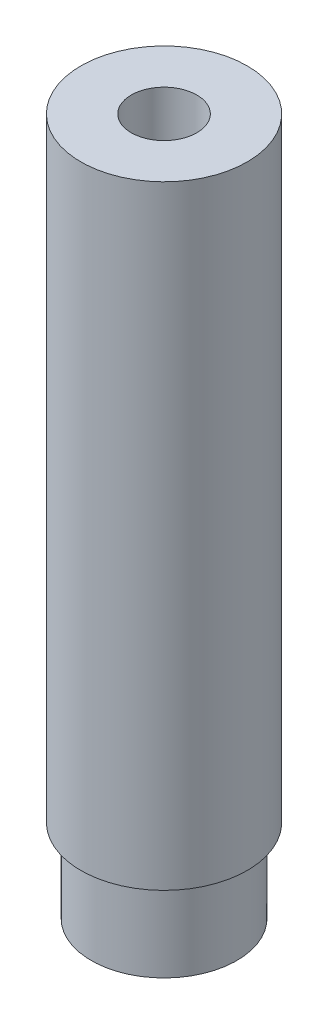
ISO-10303-21;
HEADER;
FILE_DESCRIPTION(('STEP AP214'),'2;1');
FILE_NAME('part.step','',(''),(''),'','','');
FILE_SCHEMA(('AUTOMOTIVE_DESIGN { 1 0 10303 214 1 1 1 1 }'));
ENDSEC;
DATA;
#1=APPLICATION_CONTEXT('core data for automotive mechanical design processes');
#2=APPLICATION_PROTOCOL_DEFINITION('international standard','automotive_design',2000,#1);
#3=PRODUCT_CONTEXT('',#1,'mechanical');
#4=PRODUCT('Part','Part','',(#3));
#5=PRODUCT_RELATED_PRODUCT_CATEGORY('part','',(#4));
#6=PRODUCT_DEFINITION_FORMATION('','',#4);
#7=PRODUCT_DEFINITION_CONTEXT('part definition',#1,'design');
#8=PRODUCT_DEFINITION('design','',#6,#7);
#9=PRODUCT_DEFINITION_SHAPE('','',#8);
#10=(LENGTH_UNIT() NAMED_UNIT(*) SI_UNIT(.MILLI.,.METRE.));
#11=(NAMED_UNIT(*) PLANE_ANGLE_UNIT() SI_UNIT($,.RADIAN.));
#12=(NAMED_UNIT(*) SI_UNIT($,.STERADIAN.) SOLID_ANGLE_UNIT());
#13=UNCERTAINTY_MEASURE_WITH_UNIT(LENGTH_MEASURE(1.E-05),#10,'distance_accuracy_value','');
#14=(GEOMETRIC_REPRESENTATION_CONTEXT(3) GLOBAL_UNCERTAINTY_ASSIGNED_CONTEXT((#13)) GLOBAL_UNIT_ASSIGNED_CONTEXT((#10,
#11,#12)) REPRESENTATION_CONTEXT('',''));
#15=CARTESIAN_POINT('',(0.,0.,0.));
#16=DIRECTION('',(0.,0.,1.));
#17=DIRECTION('',(1.,0.,0.));
#18=AXIS2_PLACEMENT_3D('',#15,#16,#17);
#19=CARTESIAN_POINT('',(0.,0.,0.));
#20=DIRECTION('',(0.,1.,0.));
#21=DIRECTION('',(0.,0.,1.));
#22=AXIS2_PLACEMENT_3D('',#19,#20,#21);
#23=PLANE('',#22);
#24=CARTESIAN_POINT('',(0.,0.,0.));
#25=DIRECTION('',(0.,-1.,0.));
#26=DIRECTION('',(0.,0.,-1.));
#27=AXIS2_PLACEMENT_3D('',#24,#25,#26);
#28=CIRCLE('',#27,7.);
#29=CARTESIAN_POINT('',(0.,0.,-7.));
#30=VERTEX_POINT('',#29);
#31=EDGE_CURVE('E34',#30,#30,#28,.F.);
#32=ORIENTED_EDGE('',*,*,#31,.F.);
#33=EDGE_LOOP('',(#32));
#34=FACE_BOUND('',#33,.T.);
#35=CARTESIAN_POINT('',(0.,0.,0.));
#36=DIRECTION('',(0.,1.,0.));
#37=DIRECTION('',(0.,0.,1.));
#38=AXIS2_PLACEMENT_3D('',#35,#36,#37);
#39=CIRCLE('',#38,3.15);
#40=CARTESIAN_POINT('',(0.,0.,3.15));
#41=VERTEX_POINT('',#40);
#42=EDGE_CURVE('E18',#41,#41,#39,.T.);
#43=ORIENTED_EDGE('',*,*,#42,.T.);
#44=EDGE_LOOP('',(#43));
#45=FACE_BOUND('',#44,.T.);
#46=ADVANCED_FACE('F15',(#34,#45),#23,.F.);
#47=CARTESIAN_POINT('',(0.,0.,0.));
#48=DIRECTION('',(0.,1.,0.));
#49=DIRECTION('',(0.,0.,1.));
#50=AXIS2_PLACEMENT_3D('',#47,#48,#49);
#51=CYLINDRICAL_SURFACE('',#50,3.15);
#52=ORIENTED_EDGE('',*,*,#42,.F.);
#53=EDGE_LOOP('',(#52));
#54=FACE_BOUND('',#53,.T.);
#55=CARTESIAN_POINT('',(0.,67.,0.));
#56=DIRECTION('',(0.,1.,0.));
#57=DIRECTION('',(0.,0.,1.));
#58=AXIS2_PLACEMENT_3D('',#55,#56,#57);
#59=CIRCLE('',#58,3.15);
#60=CARTESIAN_POINT('',(0.,67.,3.15));
#61=VERTEX_POINT('',#60);
#62=EDGE_CURVE('E32',#61,#61,#59,.T.);
#63=ORIENTED_EDGE('',*,*,#62,.T.);
#64=EDGE_LOOP('',(#63));
#65=FACE_BOUND('',#64,.T.);
#66=ADVANCED_FACE('F42',(#54,#65),#51,.F.);
#67=CARTESIAN_POINT('',(0.,8.,0.));
#68=DIRECTION('',(0.,-1.,0.));
#69=DIRECTION('',(0.,0.,-1.));
#70=AXIS2_PLACEMENT_3D('',#67,#68,#69);
#71=CYLINDRICAL_SURFACE('',#70,7.);
#72=CARTESIAN_POINT('',(0.,8.,0.));
#73=DIRECTION('',(0.,-1.,0.));
#74=DIRECTION('',(0.,0.,-1.));
#75=AXIS2_PLACEMENT_3D('',#72,#73,#74);
#76=CIRCLE('',#75,7.);
#77=CARTESIAN_POINT('',(0.,8.,-7.));
#78=VERTEX_POINT('',#77);
#79=EDGE_CURVE('E27',#78,#78,#76,.F.);
#80=ORIENTED_EDGE('',*,*,#79,.F.);
#81=EDGE_LOOP('',(#80));
#82=FACE_BOUND('',#81,.T.);
#83=ORIENTED_EDGE('',*,*,#31,.T.);
#84=EDGE_LOOP('',(#83));
#85=FACE_BOUND('',#84,.T.);
#86=ADVANCED_FACE('F45',(#82,#85),#71,.T.);
#87=CARTESIAN_POINT('',(0.,67.,0.));
#88=DIRECTION('',(0.,-1.,0.));
#89=DIRECTION('',(0.,0.,-1.));
#90=AXIS2_PLACEMENT_3D('',#87,#88,#89);
#91=PLANE('',#90);
#92=ORIENTED_EDGE('',*,*,#62,.F.);
#93=EDGE_LOOP('',(#92));
#94=FACE_BOUND('',#93,.T.);
#95=CARTESIAN_POINT('',(0.,67.,0.));
#96=DIRECTION('',(0.,-1.,0.));
#97=DIRECTION('',(0.,0.,-1.));
#98=AXIS2_PLACEMENT_3D('',#95,#96,#97);
#99=CIRCLE('',#98,8.);
#100=CARTESIAN_POINT('',(0.,67.,-8.));
#101=VERTEX_POINT('',#100);
#102=EDGE_CURVE('E22',#101,#101,#99,.T.);
#103=ORIENTED_EDGE('',*,*,#102,.F.);
#104=EDGE_LOOP('',(#103));
#105=FACE_BOUND('',#104,.T.);
#106=ADVANCED_FACE('F48',(#94,#105),#91,.F.);
#107=CARTESIAN_POINT('',(0.,8.,0.));
#108=DIRECTION('',(0.,-1.,0.));
#109=DIRECTION('',(0.,0.,-1.));
#110=AXIS2_PLACEMENT_3D('',#107,#108,#109);
#111=PLANE('',#110);
#112=CARTESIAN_POINT('',(0.,8.00000000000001,0.));
#113=DIRECTION('',(0.,-1.,0.));
#114=DIRECTION('',(0.,0.,-1.));
#115=AXIS2_PLACEMENT_3D('',#112,#113,#114);
#116=CIRCLE('',#115,8.);
#117=CARTESIAN_POINT('',(0.,8.00000000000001,-8.));
#118=VERTEX_POINT('',#117);
#119=EDGE_CURVE('E10',#118,#118,#116,.F.);
#120=ORIENTED_EDGE('',*,*,#119,.F.);
#121=EDGE_LOOP('',(#120));
#122=FACE_BOUND('',#121,.T.);
#123=ORIENTED_EDGE('',*,*,#79,.T.);
#124=EDGE_LOOP('',(#123));
#125=FACE_BOUND('',#124,.T.);
#126=ADVANCED_FACE('F51',(#122,#125),#111,.T.);
#127=CARTESIAN_POINT('',(0.,99.,0.));
#128=DIRECTION('',(0.,-1.,0.));
#129=DIRECTION('',(0.,0.,-1.));
#130=AXIS2_PLACEMENT_3D('',#127,#128,#129);
#131=CYLINDRICAL_SURFACE('',#130,8.);
#132=ORIENTED_EDGE('',*,*,#119,.T.);
#133=EDGE_LOOP('',(#132));
#134=FACE_BOUND('',#133,.T.);
#135=ORIENTED_EDGE('',*,*,#102,.T.);
#136=EDGE_LOOP('',(#135));
#137=FACE_BOUND('',#136,.T.);
#138=ADVANCED_FACE('F55',(#134,#137),#131,.T.);
#139=CLOSED_SHELL('',(#46,#66,#86,#106,#126,#138));
#140=MANIFOLD_SOLID_BREP('B1',#139);
#141=ADVANCED_BREP_SHAPE_REPRESENTATION('',(#18,#140),#14);
#142=SHAPE_DEFINITION_REPRESENTATION(#9,#141);
ENDSEC;
END-ISO-10303-21;
